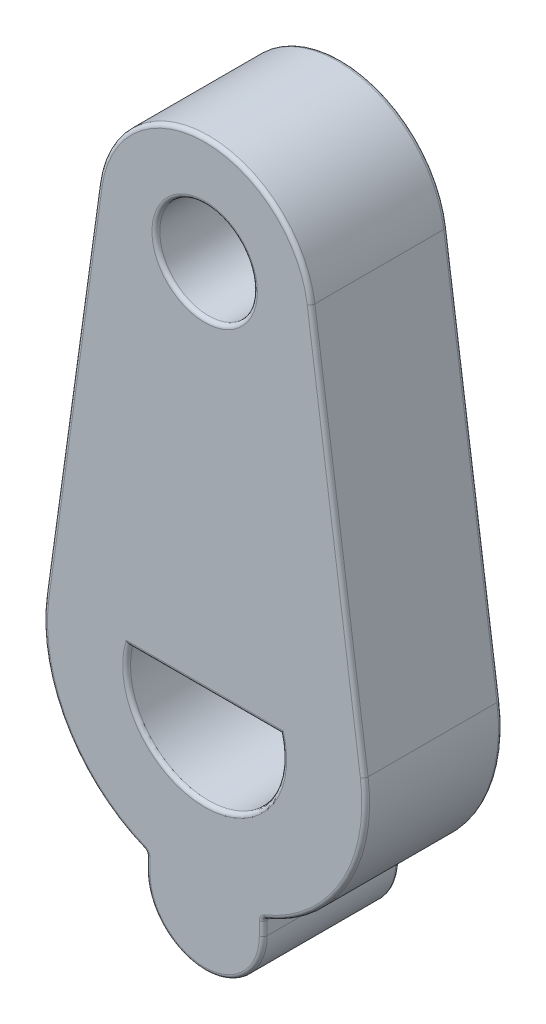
ISO-10303-21;
HEADER;
FILE_DESCRIPTION(('STEP AP214'),'2;1');
FILE_NAME('part.step','',(''),(''),'','','');
FILE_SCHEMA(('AUTOMOTIVE_DESIGN { 1 0 10303 214 1 1 1 1 }'));
ENDSEC;
DATA;
#1=APPLICATION_CONTEXT('core data for automotive mechanical design processes');
#2=APPLICATION_PROTOCOL_DEFINITION('international standard','automotive_design',2000,#1);
#3=PRODUCT_CONTEXT('',#1,'mechanical');
#4=PRODUCT('Part','Part','',(#3));
#5=PRODUCT_RELATED_PRODUCT_CATEGORY('part','',(#4));
#6=PRODUCT_DEFINITION_FORMATION('','',#4);
#7=PRODUCT_DEFINITION_CONTEXT('part definition',#1,'design');
#8=PRODUCT_DEFINITION('design','',#6,#7);
#9=PRODUCT_DEFINITION_SHAPE('','',#8);
#10=(LENGTH_UNIT() NAMED_UNIT(*) SI_UNIT(.MILLI.,.METRE.));
#11=(NAMED_UNIT(*) PLANE_ANGLE_UNIT() SI_UNIT($,.RADIAN.));
#12=(NAMED_UNIT(*) SI_UNIT($,.STERADIAN.) SOLID_ANGLE_UNIT());
#13=UNCERTAINTY_MEASURE_WITH_UNIT(LENGTH_MEASURE(1.E-05),#10,'distance_accuracy_value','');
#14=(GEOMETRIC_REPRESENTATION_CONTEXT(3) GLOBAL_UNCERTAINTY_ASSIGNED_CONTEXT((#13)) GLOBAL_UNIT_ASSIGNED_CONTEXT((#10,
#11,#12)) REPRESENTATION_CONTEXT('',''));
#15=CARTESIAN_POINT('',(0.,0.,0.));
#16=DIRECTION('',(0.,0.,1.));
#17=DIRECTION('',(1.,0.,0.));
#18=AXIS2_PLACEMENT_3D('',#15,#16,#17);
#19=CARTESIAN_POINT('',(0.,20.,0.));
#20=DIRECTION('',(0.,0.,1.));
#21=DIRECTION('',(1.,0.,0.));
#22=AXIS2_PLACEMENT_3D('',#19,#20,#21);
#23=PLANE('',#22);
#24=CARTESIAN_POINT('',(0.,20.,0.));
#25=DIRECTION('',(0.,0.,1.));
#26=DIRECTION('',(1.,0.,0.));
#27=AXIS2_PLACEMENT_3D('',#24,#25,#26);
#28=CIRCLE('',#27,4.2);
#29=CARTESIAN_POINT('',(4.20000000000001,20.,0.));
#30=VERTEX_POINT('',#29);
#31=EDGE_CURVE('E37',#30,#30,#28,.T.);
#32=ORIENTED_EDGE('',*,*,#31,.T.);
#33=EDGE_LOOP('',(#32));
#34=FACE_BOUND('',#33,.T.);
#35=CARTESIAN_POINT('',(0.,0.,0.));
#36=DIRECTION('',(0.,0.,1.));
#37=DIRECTION('',(1.,0.,0.));
#38=AXIS2_PLACEMENT_3D('',#35,#36,#37);
#39=CIRCLE('',#38,8.05);
#40=CARTESIAN_POINT('',(-3.04911515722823,-7.45019441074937,0.));
#41=VERTEX_POINT('',#40);
#42=CARTESIAN_POINT('',(-7.97353922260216,1.106875,0.));
#43=VERTEX_POINT('',#42);
#44=EDGE_CURVE('E44',#41,#43,#39,.F.);
#45=ORIENTED_EDGE('',*,*,#44,.T.);
#46=DIRECTION('',(-0.1375,-0.990501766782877,0.));
#47=VECTOR('',#46,1.);
#48=CARTESIAN_POINT('',(-5.24965936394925,20.72875,0.));
#49=LINE('',#48,#47);
#50=CARTESIAN_POINT('',(-5.24965936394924,20.72875,0.));
#51=VERTEX_POINT('',#50);
#52=EDGE_CURVE('E327',#43,#51,#49,.F.);
#53=ORIENTED_EDGE('',*,*,#52,.T.);
#54=CARTESIAN_POINT('',(0.,20.,0.));
#55=DIRECTION('',(0.,0.,1.));
#56=DIRECTION('',(1.,0.,0.));
#57=AXIS2_PLACEMENT_3D('',#54,#55,#56);
#58=CIRCLE('',#57,5.3);
#59=CARTESIAN_POINT('',(5.24965936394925,20.72875,0.));
#60=VERTEX_POINT('',#59);
#61=EDGE_CURVE('E311',#51,#60,#58,.F.);
#62=ORIENTED_EDGE('',*,*,#61,.T.);
#63=DIRECTION('',(-0.1375,0.990501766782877,0.));
#64=VECTOR('',#63,1.);
#65=CARTESIAN_POINT('',(5.24965936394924,20.72875,0.));
#66=LINE('',#65,#64);
#67=CARTESIAN_POINT('',(7.97353922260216,1.106875,0.));
#68=VERTEX_POINT('',#67);
#69=EDGE_CURVE('E313',#60,#68,#66,.F.);
#70=ORIENTED_EDGE('',*,*,#69,.T.);
#71=CARTESIAN_POINT('',(0.,0.,0.));
#72=DIRECTION('',(0.,0.,1.));
#73=DIRECTION('',(1.,0.,0.));
#74=AXIS2_PLACEMENT_3D('',#71,#72,#73);
#75=CIRCLE('',#74,8.05);
#76=CARTESIAN_POINT('',(3.04852071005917,-7.45043767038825,0.));
#77=VERTEX_POINT('',#76);
#78=EDGE_CURVE('E315',#68,#77,#75,.F.);
#79=ORIENTED_EDGE('',*,*,#78,.T.);
#80=CARTESIAN_POINT('',(3.2,-7.82064575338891,0.));
#81=DIRECTION('',(0.,0.,1.));
#82=DIRECTION('',(1.,0.,0.));
#83=AXIS2_PLACEMENT_3D('',#80,#81,#82);
#84=CIRCLE('',#83,0.400000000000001);
#85=CARTESIAN_POINT('',(2.8,-7.82064575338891,0.));
#86=VERTEX_POINT('',#85);
#87=EDGE_CURVE('E317',#77,#86,#84,.T.);
#88=ORIENTED_EDGE('',*,*,#87,.T.);
#89=DIRECTION('',(0.,1.,0.));
#90=VECTOR('',#89,1.);
#91=CARTESIAN_POINT('',(2.8,20.,0.));
#92=LINE('',#91,#90);
#93=CARTESIAN_POINT('',(2.8,-8.5,0.));
#94=VERTEX_POINT('',#93);
#95=EDGE_CURVE('E319',#86,#94,#92,.F.);
#96=ORIENTED_EDGE('',*,*,#95,.T.);
#97=CARTESIAN_POINT('',(0.,-8.5,0.));
#98=DIRECTION('',(0.,0.,1.));
#99=DIRECTION('',(1.,0.,0.));
#100=AXIS2_PLACEMENT_3D('',#97,#98,#99);
#101=CIRCLE('',#100,2.8);
#102=CARTESIAN_POINT('',(-2.79999999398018,-8.49981639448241,0.));
#103=VERTEX_POINT('',#102);
#104=EDGE_CURVE('E321',#94,#103,#101,.F.);
#105=ORIENTED_EDGE('',*,*,#104,.T.);
#106=DIRECTION('',(0.000918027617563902,-0.999999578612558,0.));
#107=VECTOR('',#106,1.);
#108=CARTESIAN_POINT('',(-2.82616133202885,19.9974055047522,0.));
#109=LINE('',#108,#107);
#110=CARTESIAN_POINT('',(-2.80062415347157,-7.82002319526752,0.));
#111=VERTEX_POINT('',#110);
#112=EDGE_CURVE('E323',#103,#111,#109,.F.);
#113=ORIENTED_EDGE('',*,*,#112,.T.);
#114=CARTESIAN_POINT('',(-3.20062398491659,-7.82039040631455,0.));
#115=DIRECTION('',(0.,0.,1.));
#116=DIRECTION('',(1.,0.,0.));
#117=AXIS2_PLACEMENT_3D('',#114,#115,#116);
#118=CIRCLE('',#117,0.399999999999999);
#119=EDGE_CURVE('E49',#111,#41,#118,.T.);
#120=ORIENTED_EDGE('',*,*,#119,.T.);
#121=EDGE_LOOP('',(#45,#53,#62,#70,#79,#88,#96,#105,#113,#120));
#122=FACE_BOUND('',#121,.T.);
#123=CARTESIAN_POINT('',(0.,0.,0.));
#124=DIRECTION('',(0.,0.,1.));
#125=DIRECTION('',(1.,0.,0.));
#126=AXIS2_PLACEMENT_3D('',#123,#124,#125);
#127=CIRCLE('',#126,4.2);
#128=CARTESIAN_POINT('',(-4.02492235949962,1.2,0.));
#129=VERTEX_POINT('',#128);
#130=CARTESIAN_POINT('',(4.02492235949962,1.2,0.));
#131=VERTEX_POINT('',#130);
#132=EDGE_CURVE('E306',#129,#131,#127,.T.);
#133=ORIENTED_EDGE('',*,*,#132,.T.);
#134=DIRECTION('',(-1.,0.,0.));
#135=VECTOR('',#134,1.);
#136=CARTESIAN_POINT('',(-3.87298334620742,1.2,0.));
#137=LINE('',#136,#135);
#138=EDGE_CURVE('E308',#131,#129,#137,.T.);
#139=ORIENTED_EDGE('',*,*,#138,.T.);
#140=EDGE_LOOP('',(#133,#139));
#141=FACE_BOUND('',#140,.T.);
#142=ADVANCED_FACE('F29',(#34,#122,#141),#23,.F.);
#143=CARTESIAN_POINT('',(0.,20.,7.));
#144=DIRECTION('',(0.,0.,1.));
#145=DIRECTION('',(1.,0.,0.));
#146=AXIS2_PLACEMENT_3D('',#143,#144,#145);
#147=PLANE('',#146);
#148=DIRECTION('',(-1.,0.,0.));
#149=VECTOR('',#148,1.);
#150=CARTESIAN_POINT('',(0.,1.2,7.));
#151=LINE('',#150,#149);
#152=CARTESIAN_POINT('',(-4.02492235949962,1.2,7.));
#153=VERTEX_POINT('',#152);
#154=CARTESIAN_POINT('',(4.02492235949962,1.2,7.));
#155=VERTEX_POINT('',#154);
#156=EDGE_CURVE('E216',#153,#155,#151,.F.);
#157=ORIENTED_EDGE('',*,*,#156,.T.);
#158=CARTESIAN_POINT('',(0.,0.,7.));
#159=DIRECTION('',(0.,0.,1.));
#160=DIRECTION('',(1.,0.,0.));
#161=AXIS2_PLACEMENT_3D('',#158,#159,#160);
#162=CIRCLE('',#161,4.2);
#163=EDGE_CURVE('E253',#155,#153,#162,.F.);
#164=ORIENTED_EDGE('',*,*,#163,.T.);
#165=EDGE_LOOP('',(#157,#164));
#166=FACE_BOUND('',#165,.T.);
#167=CARTESIAN_POINT('',(0.,0.,7.));
#168=DIRECTION('',(0.,0.,1.));
#169=DIRECTION('',(1.,0.,0.));
#170=AXIS2_PLACEMENT_3D('',#167,#168,#169);
#171=CIRCLE('',#170,8.05);
#172=CARTESIAN_POINT('',(3.04852071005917,-7.45043767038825,7.));
#173=VERTEX_POINT('',#172);
#174=CARTESIAN_POINT('',(7.97353922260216,1.106875,7.));
#175=VERTEX_POINT('',#174);
#176=EDGE_CURVE('E247',#173,#175,#171,.T.);
#177=ORIENTED_EDGE('',*,*,#176,.T.);
#178=DIRECTION('',(-0.1375,0.990501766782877,0.));
#179=VECTOR('',#178,1.);
#180=CARTESIAN_POINT('',(5.24965936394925,20.72875,7.));
#181=LINE('',#180,#179);
#182=CARTESIAN_POINT('',(5.24965936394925,20.72875,7.));
#183=VERTEX_POINT('',#182);
#184=EDGE_CURVE('E249',#175,#183,#181,.T.);
#185=ORIENTED_EDGE('',*,*,#184,.T.);
#186=CARTESIAN_POINT('',(0.,20.,7.));
#187=DIRECTION('',(0.,0.,1.));
#188=DIRECTION('',(1.,0.,0.));
#189=AXIS2_PLACEMENT_3D('',#186,#187,#188);
#190=CIRCLE('',#189,5.3);
#191=CARTESIAN_POINT('',(-5.24965936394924,20.72875,7.));
#192=VERTEX_POINT('',#191);
#193=EDGE_CURVE('E226',#183,#192,#190,.T.);
#194=ORIENTED_EDGE('',*,*,#193,.T.);
#195=DIRECTION('',(-0.1375,-0.990501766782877,0.));
#196=VECTOR('',#195,1.);
#197=CARTESIAN_POINT('',(-7.97353922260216,1.10687499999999,7.));
#198=LINE('',#197,#196);
#199=CARTESIAN_POINT('',(-7.97353922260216,1.106875,7.));
#200=VERTEX_POINT('',#199);
#201=EDGE_CURVE('E233',#192,#200,#198,.T.);
#202=ORIENTED_EDGE('',*,*,#201,.T.);
#203=CARTESIAN_POINT('',(0.,0.,7.));
#204=DIRECTION('',(0.,0.,1.));
#205=DIRECTION('',(1.,0.,0.));
#206=AXIS2_PLACEMENT_3D('',#203,#204,#205);
#207=CIRCLE('',#206,8.05);
#208=CARTESIAN_POINT('',(-3.04911515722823,-7.45019441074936,7.));
#209=VERTEX_POINT('',#208);
#210=EDGE_CURVE('E235',#200,#209,#207,.T.);
#211=ORIENTED_EDGE('',*,*,#210,.T.);
#212=CARTESIAN_POINT('',(-3.20062398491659,-7.82039040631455,7.));
#213=DIRECTION('',(0.,0.,1.));
#214=DIRECTION('',(1.,0.,0.));
#215=AXIS2_PLACEMENT_3D('',#212,#213,#214);
#216=CIRCLE('',#215,0.399999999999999);
#217=CARTESIAN_POINT('',(-2.80062415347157,-7.82002319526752,7.));
#218=VERTEX_POINT('',#217);
#219=EDGE_CURVE('E237',#209,#218,#216,.F.);
#220=ORIENTED_EDGE('',*,*,#219,.T.);
#221=DIRECTION('',(0.000918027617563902,-0.999999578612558,0.));
#222=VECTOR('',#221,1.);
#223=CARTESIAN_POINT('',(-2.80000008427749,-8.49981639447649,7.));
#224=LINE('',#223,#222);
#225=CARTESIAN_POINT('',(-2.79999991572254,-8.49999999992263,7.));
#226=VERTEX_POINT('',#225);
#227=EDGE_CURVE('E239',#218,#226,#224,.T.);
#228=ORIENTED_EDGE('',*,*,#227,.T.);
#229=CARTESIAN_POINT('',(0.,-8.5,7.));
#230=DIRECTION('',(0.,0.,1.));
#231=DIRECTION('',(1.,0.,0.));
#232=AXIS2_PLACEMENT_3D('',#229,#230,#231);
#233=CIRCLE('',#232,2.8);
#234=CARTESIAN_POINT('',(2.8,-8.5,7.));
#235=VERTEX_POINT('',#234);
#236=EDGE_CURVE('E241',#226,#235,#233,.T.);
#237=ORIENTED_EDGE('',*,*,#236,.T.);
#238=DIRECTION('',(0.,1.,0.));
#239=VECTOR('',#238,1.);
#240=CARTESIAN_POINT('',(2.8,-7.82064575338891,7.));
#241=LINE('',#240,#239);
#242=CARTESIAN_POINT('',(2.8,-7.82064575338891,7.));
#243=VERTEX_POINT('',#242);
#244=EDGE_CURVE('E243',#235,#243,#241,.T.);
#245=ORIENTED_EDGE('',*,*,#244,.T.);
#246=CARTESIAN_POINT('',(3.2,-7.82064575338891,7.));
#247=DIRECTION('',(0.,0.,1.));
#248=DIRECTION('',(1.,0.,0.));
#249=AXIS2_PLACEMENT_3D('',#246,#247,#248);
#250=CIRCLE('',#249,0.400000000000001);
#251=EDGE_CURVE('E245',#243,#173,#250,.F.);
#252=ORIENTED_EDGE('',*,*,#251,.T.);
#253=EDGE_LOOP('',(#177,#185,#194,#202,#211,#220,#228,#237,#245,#252));
#254=FACE_BOUND('',#253,.T.);
#255=CARTESIAN_POINT('',(0.,20.,7.));
#256=DIRECTION('',(0.,0.,1.));
#257=DIRECTION('',(1.,0.,0.));
#258=AXIS2_PLACEMENT_3D('',#255,#256,#257);
#259=CIRCLE('',#258,2.7);
#260=CARTESIAN_POINT('',(2.70000000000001,20.,7.));
#261=VERTEX_POINT('',#260);
#262=EDGE_CURVE('E223',#261,#261,#259,.F.);
#263=ORIENTED_EDGE('',*,*,#262,.T.);
#264=EDGE_LOOP('',(#263));
#265=FACE_BOUND('',#264,.T.);
#266=ADVANCED_FACE('F363',(#166,#254,#265),#147,.T.);
#267=CARTESIAN_POINT('',(0.,20.,7.));
#268=DIRECTION('',(0.,0.,-1.));
#269=DIRECTION('',(-1.,0.,0.));
#270=AXIS2_PLACEMENT_3D('',#267,#268,#269);
#271=CYLINDRICAL_SURFACE('',#270,5.5);
#272=DIRECTION('',(0.,0.,-1.));
#273=VECTOR('',#272,1.);
#274=CARTESIAN_POINT('',(-5.44775971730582,20.75625,7.));
#275=LINE('',#274,#273);
#276=CARTESIAN_POINT('',(-5.44775971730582,20.75625,6.8));
#277=VERTEX_POINT('',#276);
#278=CARTESIAN_POINT('',(-5.44775971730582,20.75625,0.2));
#279=VERTEX_POINT('',#278);
#280=EDGE_CURVE('E228',#277,#279,#275,.T.);
#281=ORIENTED_EDGE('',*,*,#280,.F.);
#282=CARTESIAN_POINT('',(0.,20.,6.8));
#283=DIRECTION('',(0.,0.,1.));
#284=DIRECTION('',(1.,0.,0.));
#285=AXIS2_PLACEMENT_3D('',#282,#283,#284);
#286=CIRCLE('',#285,5.5);
#287=CARTESIAN_POINT('',(5.44775971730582,20.75625,6.8));
#288=VERTEX_POINT('',#287);
#289=EDGE_CURVE('E295',#277,#288,#286,.F.);
#290=ORIENTED_EDGE('',*,*,#289,.T.);
#291=DIRECTION('',(0.,0.,-1.));
#292=VECTOR('',#291,1.);
#293=CARTESIAN_POINT('',(5.44775971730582,20.75625,7.));
#294=LINE('',#293,#292);
#295=CARTESIAN_POINT('',(5.44775971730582,20.75625,0.2));
#296=VERTEX_POINT('',#295);
#297=EDGE_CURVE('E448',#288,#296,#294,.T.);
#298=ORIENTED_EDGE('',*,*,#297,.T.);
#299=CARTESIAN_POINT('',(0.,20.,0.2));
#300=DIRECTION('',(0.,0.,1.));
#301=DIRECTION('',(1.,0.,0.));
#302=AXIS2_PLACEMENT_3D('',#299,#300,#301);
#303=CIRCLE('',#302,5.5);
#304=EDGE_CURVE('E293',#296,#279,#303,.T.);
#305=ORIENTED_EDGE('',*,*,#304,.T.);
#306=EDGE_LOOP('',(#281,#290,#298,#305));
#307=FACE_BOUND('',#306,.T.);
#308=ADVANCED_FACE('F31',(#307),#271,.T.);
#309=CARTESIAN_POINT('',(-5.44775971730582,20.75625,7.));
#310=DIRECTION('',(0.990501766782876,-0.1375,0.));
#311=DIRECTION('',(0.1375,0.990501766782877,0.));
#312=AXIS2_PLACEMENT_3D('',#309,#310,#311);
#313=PLANE('',#312);
#314=DIRECTION('',(0.,0.,-1.));
#315=VECTOR('',#314,1.);
#316=CARTESIAN_POINT('',(-8.17163957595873,1.134375,7.));
#317=LINE('',#316,#315);
#318=CARTESIAN_POINT('',(-8.17163957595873,1.134375,6.8));
#319=VERTEX_POINT('',#318);
#320=CARTESIAN_POINT('',(-8.17163957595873,1.134375,0.2));
#321=VERTEX_POINT('',#320);
#322=EDGE_CURVE('E414',#319,#321,#317,.T.);
#323=ORIENTED_EDGE('',*,*,#322,.F.);
#324=DIRECTION('',(-0.1375,-0.990501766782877,0.));
#325=VECTOR('',#324,1.);
#326=CARTESIAN_POINT('',(-5.44775971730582,20.75625,6.8));
#327=LINE('',#326,#325);
#328=EDGE_CURVE('E291',#319,#277,#327,.F.);
#329=ORIENTED_EDGE('',*,*,#328,.T.);
#330=ORIENTED_EDGE('',*,*,#280,.T.);
#331=DIRECTION('',(-0.1375,-0.990501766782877,0.));
#332=VECTOR('',#331,1.);
#333=CARTESIAN_POINT('',(-5.44775971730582,20.75625,0.2));
#334=LINE('',#333,#332);
#335=EDGE_CURVE('E288',#279,#321,#334,.T.);
#336=ORIENTED_EDGE('',*,*,#335,.T.);
#337=EDGE_LOOP('',(#323,#329,#330,#336));
#338=FACE_BOUND('',#337,.T.);
#339=ADVANCED_FACE('F404',(#338),#313,.F.);
#340=CARTESIAN_POINT('',(0.,0.,7.));
#341=DIRECTION('',(0.,0.,-1.));
#342=DIRECTION('',(-1.,0.,0.));
#343=AXIS2_PLACEMENT_3D('',#340,#341,#342);
#344=CYLINDRICAL_SURFACE('',#343,8.25);
#345=DIRECTION('',(0.,0.,-1.));
#346=VECTOR('',#345,1.);
#347=CARTESIAN_POINT('',(-3.12486957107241,-7.63529240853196,7.));
#348=LINE('',#347,#346);
#349=CARTESIAN_POINT('',(-3.12486957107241,-7.63529240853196,6.8));
#350=VERTEX_POINT('',#349);
#351=CARTESIAN_POINT('',(-3.12486957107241,-7.63529240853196,0.2));
#352=VERTEX_POINT('',#351);
#353=EDGE_CURVE('E420',#350,#352,#348,.T.);
#354=ORIENTED_EDGE('',*,*,#353,.F.);
#355=CARTESIAN_POINT('',(0.,0.,6.8));
#356=DIRECTION('',(0.,0.,1.));
#357=DIRECTION('',(1.,0.,0.));
#358=AXIS2_PLACEMENT_3D('',#355,#356,#357);
#359=CIRCLE('',#358,8.25);
#360=EDGE_CURVE('E286',#350,#319,#359,.F.);
#361=ORIENTED_EDGE('',*,*,#360,.T.);
#362=ORIENTED_EDGE('',*,*,#322,.T.);
#363=CARTESIAN_POINT('',(0.,0.,0.2));
#364=DIRECTION('',(0.,0.,1.));
#365=DIRECTION('',(1.,0.,0.));
#366=AXIS2_PLACEMENT_3D('',#363,#364,#365);
#367=CIRCLE('',#366,8.25);
#368=EDGE_CURVE('E284',#321,#352,#367,.T.);
#369=ORIENTED_EDGE('',*,*,#368,.T.);
#370=EDGE_LOOP('',(#354,#361,#362,#369));
#371=FACE_BOUND('',#370,.T.);
#372=ADVANCED_FACE('F401',(#371),#344,.T.);
#373=CARTESIAN_POINT('',(-3.20062398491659,-7.82039040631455,7.));
#374=DIRECTION('',(0.,0.,-1.));
#375=DIRECTION('',(-1.,0.,0.));
#376=AXIS2_PLACEMENT_3D('',#373,#374,#375);
#377=CYLINDRICAL_SURFACE('',#376,0.199999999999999);
#378=DIRECTION('',(0.,0.,-1.));
#379=VECTOR('',#378,1.);
#380=CARTESIAN_POINT('',(-3.00062406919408,-7.82020680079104,7.));
#381=LINE('',#380,#379);
#382=CARTESIAN_POINT('',(-3.00062406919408,-7.82020680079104,6.8));
#383=VERTEX_POINT('',#382);
#384=CARTESIAN_POINT('',(-3.00062406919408,-7.82020680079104,0.2));
#385=VERTEX_POINT('',#384);
#386=EDGE_CURVE('E531',#383,#385,#381,.T.);
#387=ORIENTED_EDGE('',*,*,#386,.F.);
#388=CARTESIAN_POINT('',(-3.20062398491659,-7.82039040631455,6.8));
#389=DIRECTION('',(0.,0.,1.));
#390=DIRECTION('',(1.,0.,0.));
#391=AXIS2_PLACEMENT_3D('',#388,#389,#390);
#392=CIRCLE('',#391,0.199999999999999);
#393=EDGE_CURVE('E282',#383,#350,#392,.T.);
#394=ORIENTED_EDGE('',*,*,#393,.T.);
#395=ORIENTED_EDGE('',*,*,#353,.T.);
#396=CARTESIAN_POINT('',(-3.20062398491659,-7.82039040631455,0.2));
#397=DIRECTION('',(0.,0.,1.));
#398=DIRECTION('',(1.,0.,0.));
#399=AXIS2_PLACEMENT_3D('',#396,#397,#398);
#400=CIRCLE('',#399,0.199999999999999);
#401=EDGE_CURVE('E280',#352,#385,#400,.F.);
#402=ORIENTED_EDGE('',*,*,#401,.T.);
#403=EDGE_LOOP('',(#387,#394,#395,#402));
#404=FACE_BOUND('',#403,.T.);
#405=ADVANCED_FACE('F397',(#404),#377,.F.);
#406=CARTESIAN_POINT('',(-3.,-8.5,7.));
#407=DIRECTION('',(0.999999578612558,0.000918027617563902,0.));
#408=DIRECTION('',(-0.000918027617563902,0.999999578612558,0.));
#409=AXIS2_PLACEMENT_3D('',#406,#407,#408);
#410=PLANE('',#409);
#411=DIRECTION('',(0.,0.,-1.));
#412=VECTOR('',#411,1.);
#413=CARTESIAN_POINT('',(-3.,-8.5,7.));
#414=LINE('',#413,#412);
#415=CARTESIAN_POINT('',(-3.,-8.5,6.8));
#416=VERTEX_POINT('',#415);
#417=CARTESIAN_POINT('',(-3.,-8.5,0.2));
#418=VERTEX_POINT('',#417);
#419=EDGE_CURVE('E528',#416,#418,#414,.T.);
#420=ORIENTED_EDGE('',*,*,#419,.F.);
#421=DIRECTION('',(0.000918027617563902,-0.999999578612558,0.));
#422=VECTOR('',#421,1.);
#423=CARTESIAN_POINT('',(-3.00062406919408,-7.82020680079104,6.8));
#424=LINE('',#423,#422);
#425=EDGE_CURVE('E278',#416,#383,#424,.F.);
#426=ORIENTED_EDGE('',*,*,#425,.T.);
#427=ORIENTED_EDGE('',*,*,#386,.T.);
#428=DIRECTION('',(0.000918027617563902,-0.999999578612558,0.));
#429=VECTOR('',#428,1.);
#430=CARTESIAN_POINT('',(-3.,-8.5,0.2));
#431=LINE('',#430,#429);
#432=EDGE_CURVE('E276',#385,#418,#431,.T.);
#433=ORIENTED_EDGE('',*,*,#432,.T.);
#434=EDGE_LOOP('',(#420,#426,#427,#433));
#435=FACE_BOUND('',#434,.T.);
#436=ADVANCED_FACE('F393',(#435),#410,.F.);
#437=CARTESIAN_POINT('',(0.,-8.5,7.));
#438=DIRECTION('',(0.,0.,-1.));
#439=DIRECTION('',(-1.,0.,0.));
#440=AXIS2_PLACEMENT_3D('',#437,#438,#439);
#441=CYLINDRICAL_SURFACE('',#440,3.);
#442=DIRECTION('',(0.,0.,-1.));
#443=VECTOR('',#442,1.);
#444=CARTESIAN_POINT('',(3.,-8.5,7.));
#445=LINE('',#444,#443);
#446=CARTESIAN_POINT('',(3.,-8.5,6.8));
#447=VERTEX_POINT('',#446);
#448=CARTESIAN_POINT('',(3.,-8.5,0.2));
#449=VERTEX_POINT('',#448);
#450=EDGE_CURVE('E525',#447,#449,#445,.T.);
#451=ORIENTED_EDGE('',*,*,#450,.F.);
#452=CARTESIAN_POINT('',(0.,-8.5,6.8));
#453=DIRECTION('',(0.,0.,1.));
#454=DIRECTION('',(1.,0.,0.));
#455=AXIS2_PLACEMENT_3D('',#452,#453,#454);
#456=CIRCLE('',#455,3.);
#457=EDGE_CURVE('E274',#447,#416,#456,.F.);
#458=ORIENTED_EDGE('',*,*,#457,.T.);
#459=ORIENTED_EDGE('',*,*,#419,.T.);
#460=CARTESIAN_POINT('',(0.,-8.5,0.2));
#461=DIRECTION('',(0.,0.,1.));
#462=DIRECTION('',(1.,0.,0.));
#463=AXIS2_PLACEMENT_3D('',#460,#461,#462);
#464=CIRCLE('',#463,3.);
#465=EDGE_CURVE('E272',#418,#449,#464,.T.);
#466=ORIENTED_EDGE('',*,*,#465,.T.);
#467=EDGE_LOOP('',(#451,#458,#459,#466));
#468=FACE_BOUND('',#467,.T.);
#469=ADVANCED_FACE('F389',(#468),#441,.T.);
#470=CARTESIAN_POINT('',(3.,-8.5,7.));
#471=DIRECTION('',(-1.,0.,0.));
#472=DIRECTION('',(0.,0.,1.));
#473=AXIS2_PLACEMENT_3D('',#470,#471,#472);
#474=PLANE('',#473);
#475=DIRECTION('',(0.,0.,-1.));
#476=VECTOR('',#475,1.);
#477=CARTESIAN_POINT('',(3.,-7.82064575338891,7.));
#478=LINE('',#477,#476);
#479=CARTESIAN_POINT('',(3.,-7.82064575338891,6.8));
#480=VERTEX_POINT('',#479);
#481=CARTESIAN_POINT('',(3.,-7.82064575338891,0.2));
#482=VERTEX_POINT('',#481);
#483=EDGE_CURVE('E476',#480,#482,#478,.T.);
#484=ORIENTED_EDGE('',*,*,#483,.F.);
#485=DIRECTION('',(0.,1.,0.));
#486=VECTOR('',#485,1.);
#487=CARTESIAN_POINT('',(3.,-8.5,6.8));
#488=LINE('',#487,#486);
#489=EDGE_CURVE('E270',#480,#447,#488,.F.);
#490=ORIENTED_EDGE('',*,*,#489,.T.);
#491=ORIENTED_EDGE('',*,*,#450,.T.);
#492=DIRECTION('',(0.,1.,0.));
#493=VECTOR('',#492,1.);
#494=CARTESIAN_POINT('',(3.,-8.5,0.2));
#495=LINE('',#494,#493);
#496=EDGE_CURVE('E268',#449,#482,#495,.T.);
#497=ORIENTED_EDGE('',*,*,#496,.T.);
#498=EDGE_LOOP('',(#484,#490,#491,#497));
#499=FACE_BOUND('',#498,.T.);
#500=ADVANCED_FACE('F385',(#499),#474,.F.);
#501=CARTESIAN_POINT('',(3.2,-7.82064575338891,7.));
#502=DIRECTION('',(0.,0.,-1.));
#503=DIRECTION('',(-1.,0.,0.));
#504=AXIS2_PLACEMENT_3D('',#501,#502,#503);
#505=CYLINDRICAL_SURFACE('',#504,0.200000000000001);
#506=DIRECTION('',(0.,0.,-1.));
#507=VECTOR('',#506,1.);
#508=CARTESIAN_POINT('',(3.12426035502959,-7.63554171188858,7.));
#509=LINE('',#508,#507);
#510=CARTESIAN_POINT('',(3.12426035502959,-7.63554171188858,6.8));
#511=VERTEX_POINT('',#510);
#512=CARTESIAN_POINT('',(3.12426035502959,-7.63554171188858,0.2));
#513=VERTEX_POINT('',#512);
#514=EDGE_CURVE('E470',#511,#513,#509,.T.);
#515=ORIENTED_EDGE('',*,*,#514,.F.);
#516=CARTESIAN_POINT('',(3.2,-7.82064575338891,6.8));
#517=DIRECTION('',(0.,0.,1.));
#518=DIRECTION('',(1.,0.,0.));
#519=AXIS2_PLACEMENT_3D('',#516,#517,#518);
#520=CIRCLE('',#519,0.200000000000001);
#521=EDGE_CURVE('E266',#511,#480,#520,.T.);
#522=ORIENTED_EDGE('',*,*,#521,.T.);
#523=ORIENTED_EDGE('',*,*,#483,.T.);
#524=CARTESIAN_POINT('',(3.2,-7.82064575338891,0.2));
#525=DIRECTION('',(0.,0.,1.));
#526=DIRECTION('',(1.,0.,0.));
#527=AXIS2_PLACEMENT_3D('',#524,#525,#526);
#528=CIRCLE('',#527,0.200000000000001);
#529=EDGE_CURVE('E264',#482,#513,#528,.F.);
#530=ORIENTED_EDGE('',*,*,#529,.T.);
#531=EDGE_LOOP('',(#515,#522,#523,#530));
#532=FACE_BOUND('',#531,.T.);
#533=ADVANCED_FACE('F381',(#532),#505,.F.);
#534=CARTESIAN_POINT('',(0.,0.,7.));
#535=DIRECTION('',(0.,0.,-1.));
#536=DIRECTION('',(-1.,0.,0.));
#537=AXIS2_PLACEMENT_3D('',#534,#535,#536);
#538=CYLINDRICAL_SURFACE('',#537,8.25);
#539=DIRECTION('',(0.,0.,-1.));
#540=VECTOR('',#539,1.);
#541=CARTESIAN_POINT('',(8.17163957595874,1.134375,7.));
#542=LINE('',#541,#540);
#543=CARTESIAN_POINT('',(8.17163957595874,1.134375,6.8));
#544=VERTEX_POINT('',#543);
#545=CARTESIAN_POINT('',(8.17163957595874,1.134375,0.2));
#546=VERTEX_POINT('',#545);
#547=EDGE_CURVE('E454',#544,#546,#542,.T.);
#548=ORIENTED_EDGE('',*,*,#547,.F.);
#549=CARTESIAN_POINT('',(0.,0.,6.8));
#550=DIRECTION('',(0.,0.,1.));
#551=DIRECTION('',(1.,0.,0.));
#552=AXIS2_PLACEMENT_3D('',#549,#550,#551);
#553=CIRCLE('',#552,8.25);
#554=EDGE_CURVE('E262',#544,#511,#553,.F.);
#555=ORIENTED_EDGE('',*,*,#554,.T.);
#556=ORIENTED_EDGE('',*,*,#514,.T.);
#557=CARTESIAN_POINT('',(0.,0.,0.2));
#558=DIRECTION('',(0.,0.,1.));
#559=DIRECTION('',(1.,0.,0.));
#560=AXIS2_PLACEMENT_3D('',#557,#558,#559);
#561=CIRCLE('',#560,8.25);
#562=EDGE_CURVE('E260',#513,#546,#561,.T.);
#563=ORIENTED_EDGE('',*,*,#562,.T.);
#564=EDGE_LOOP('',(#548,#555,#556,#563));
#565=FACE_BOUND('',#564,.T.);
#566=ADVANCED_FACE('F377',(#565),#538,.T.);
#567=CARTESIAN_POINT('',(5.44775971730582,20.75625,7.));
#568=DIRECTION('',(-0.990501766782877,-0.1375,0.));
#569=DIRECTION('',(0.1375,-0.990501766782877,0.));
#570=AXIS2_PLACEMENT_3D('',#567,#568,#569);
#571=PLANE('',#570);
#572=ORIENTED_EDGE('',*,*,#297,.F.);
#573=DIRECTION('',(-0.1375,0.990501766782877,0.));
#574=VECTOR('',#573,1.);
#575=CARTESIAN_POINT('',(8.17163957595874,1.134375,6.8));
#576=LINE('',#575,#574);
#577=EDGE_CURVE('E257',#288,#544,#576,.F.);
#578=ORIENTED_EDGE('',*,*,#577,.T.);
#579=ORIENTED_EDGE('',*,*,#547,.T.);
#580=DIRECTION('',(-0.1375,0.990501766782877,0.));
#581=VECTOR('',#580,1.);
#582=CARTESIAN_POINT('',(5.44775971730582,20.75625,0.2));
#583=LINE('',#582,#581);
#584=EDGE_CURVE('E203',#546,#296,#583,.T.);
#585=ORIENTED_EDGE('',*,*,#584,.T.);
#586=EDGE_LOOP('',(#572,#578,#579,#585));
#587=FACE_BOUND('',#586,.T.);
#588=ADVANCED_FACE('F374',(#587),#571,.F.);
#589=CARTESIAN_POINT('',(0.,20.,7.));
#590=DIRECTION('',(0.,0.,-1.));
#591=DIRECTION('',(-1.,0.,0.));
#592=AXIS2_PLACEMENT_3D('',#589,#590,#591);
#593=CYLINDRICAL_SURFACE('',#592,2.5);
#594=CARTESIAN_POINT('',(0.,20.,6.8));
#595=DIRECTION('',(0.,0.,1.));
#596=DIRECTION('',(1.,0.,0.));
#597=AXIS2_PLACEMENT_3D('',#594,#595,#596);
#598=CIRCLE('',#597,2.5);
#599=CARTESIAN_POINT('',(2.50000000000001,20.,6.8));
#600=VERTEX_POINT('',#599);
#601=EDGE_CURVE('E297',#600,#600,#598,.T.);
#602=ORIENTED_EDGE('',*,*,#601,.T.);
#603=EDGE_LOOP('',(#602));
#604=FACE_BOUND('',#603,.T.);
#605=CARTESIAN_POINT('',(0.,20.,0.));
#606=DIRECTION('',(0.,0.,1.));
#607=DIRECTION('',(1.,0.,0.));
#608=AXIS2_PLACEMENT_3D('',#605,#606,#607);
#609=CIRCLE('',#608,2.5);
#610=CARTESIAN_POINT('',(2.50000000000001,20.,0.));
#611=VERTEX_POINT('',#610);
#612=EDGE_CURVE('E455',#611,#611,#609,.T.);
#613=ORIENTED_EDGE('',*,*,#612,.F.);
#614=EDGE_LOOP('',(#613));
#615=FACE_BOUND('',#614,.T.);
#616=ADVANCED_FACE('F371',(#604,#615),#593,.F.);
#617=CARTESIAN_POINT('',(0.,0.,7.));
#618=DIRECTION('',(0.,0.,-1.));
#619=DIRECTION('',(-1.,0.,0.));
#620=AXIS2_PLACEMENT_3D('',#617,#618,#619);
#621=CYLINDRICAL_SURFACE('',#620,4.);
#622=DIRECTION('',(0.,0.,-1.));
#623=VECTOR('',#622,1.);
#624=CARTESIAN_POINT('',(-3.87298334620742,1.,7.));
#625=LINE('',#624,#623);
#626=CARTESIAN_POINT('',(-3.87298334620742,1.,6.8));
#627=VERTEX_POINT('',#626);
#628=CARTESIAN_POINT('',(-3.87298334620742,1.,0.200000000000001));
#629=VERTEX_POINT('',#628);
#630=EDGE_CURVE('E195',#627,#629,#625,.T.);
#631=ORIENTED_EDGE('',*,*,#630,.F.);
#632=CARTESIAN_POINT('',(0.,0.,6.8));
#633=DIRECTION('',(0.,0.,1.));
#634=DIRECTION('',(1.,0.,0.));
#635=AXIS2_PLACEMENT_3D('',#632,#633,#634);
#636=CIRCLE('',#635,4.);
#637=CARTESIAN_POINT('',(3.87298334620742,1.,6.8));
#638=VERTEX_POINT('',#637);
#639=EDGE_CURVE('E209',#627,#638,#636,.T.);
#640=ORIENTED_EDGE('',*,*,#639,.T.);
#641=DIRECTION('',(0.,0.,-1.));
#642=VECTOR('',#641,1.);
#643=CARTESIAN_POINT('',(3.87298334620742,1.,7.));
#644=LINE('',#643,#642);
#645=CARTESIAN_POINT('',(3.87298334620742,1.,0.2));
#646=VERTEX_POINT('',#645);
#647=EDGE_CURVE('E198',#638,#646,#644,.T.);
#648=ORIENTED_EDGE('',*,*,#647,.T.);
#649=CARTESIAN_POINT('',(0.,0.,0.2));
#650=DIRECTION('',(0.,0.,1.));
#651=DIRECTION('',(1.,0.,0.));
#652=AXIS2_PLACEMENT_3D('',#649,#650,#651);
#653=CIRCLE('',#652,4.);
#654=EDGE_CURVE('E211',#646,#629,#653,.F.);
#655=ORIENTED_EDGE('',*,*,#654,.T.);
#656=EDGE_LOOP('',(#631,#640,#648,#655));
#657=FACE_BOUND('',#656,.T.);
#658=ADVANCED_FACE('F207',(#657),#621,.F.);
#659=CARTESIAN_POINT('',(-3.87298334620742,1.,7.));
#660=DIRECTION('',(0.,-1.,0.));
#661=DIRECTION('',(0.,0.,-1.));
#662=AXIS2_PLACEMENT_3D('',#659,#660,#661);
#663=PLANE('',#662);
#664=ORIENTED_EDGE('',*,*,#647,.F.);
#665=DIRECTION('',(-1.,0.,0.));
#666=VECTOR('',#665,1.);
#667=CARTESIAN_POINT('',(-3.87298334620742,1.,6.8));
#668=LINE('',#667,#666);
#669=EDGE_CURVE('E191',#638,#627,#668,.T.);
#670=ORIENTED_EDGE('',*,*,#669,.T.);
#671=ORIENTED_EDGE('',*,*,#630,.T.);
#672=DIRECTION('',(-1.,0.,0.));
#673=VECTOR('',#672,1.);
#674=CARTESIAN_POINT('',(3.87298334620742,1.,0.2));
#675=LINE('',#674,#673);
#676=EDGE_CURVE('E204',#629,#646,#675,.F.);
#677=ORIENTED_EDGE('',*,*,#676,.T.);
#678=EDGE_LOOP('',(#664,#670,#671,#677));
#679=FACE_BOUND('',#678,.T.);
#680=ADVANCED_FACE('F193',(#679),#663,.T.);
#681=CARTESIAN_POINT('',(0.,20.,0.));
#682=DIRECTION('',(0.,0.,-1.));
#683=DIRECTION('',(-1.,0.,0.));
#684=AXIS2_PLACEMENT_3D('',#681,#682,#683);
#685=PLANE('',#684);
#686=ORIENTED_EDGE('',*,*,#612,.T.);
#687=EDGE_LOOP('',(#686));
#688=FACE_BOUND('',#687,.T.);
#689=ADVANCED_FACE('F344',(#688),#685,.F.);
#690=CARTESIAN_POINT('',(0.,20.,-1.));
#691=DIRECTION('',(0.,0.,1.));
#692=DIRECTION('',(1.,0.,0.));
#693=AXIS2_PLACEMENT_3D('',#690,#691,#692);
#694=CYLINDRICAL_SURFACE('',#693,4.);
#695=CARTESIAN_POINT('',(0.,20.,-0.2));
#696=DIRECTION('',(0.,0.,1.));
#697=DIRECTION('',(1.,0.,0.));
#698=AXIS2_PLACEMENT_3D('',#695,#696,#697);
#699=CIRCLE('',#698,4.);
#700=CARTESIAN_POINT('',(4.00000000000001,20.,-0.2));
#701=VERTEX_POINT('',#700);
#702=EDGE_CURVE('E303',#701,#701,#699,.F.);
#703=ORIENTED_EDGE('',*,*,#702,.T.);
#704=EDGE_LOOP('',(#703));
#705=FACE_BOUND('',#704,.T.);
#706=CARTESIAN_POINT('',(0.,20.,-0.8));
#707=DIRECTION('',(0.,0.,-1.));
#708=DIRECTION('',(-1.,0.,0.));
#709=AXIS2_PLACEMENT_3D('',#706,#707,#708);
#710=CIRCLE('',#709,4.);
#711=CARTESIAN_POINT('',(-3.99999999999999,20.,-0.8));
#712=VERTEX_POINT('',#711);
#713=EDGE_CURVE('E300',#712,#712,#710,.F.);
#714=ORIENTED_EDGE('',*,*,#713,.T.);
#715=EDGE_LOOP('',(#714));
#716=FACE_BOUND('',#715,.T.);
#717=ADVANCED_FACE('F340',(#705,#716),#694,.T.);
#718=CARTESIAN_POINT('',(0.,20.,-1.));
#719=DIRECTION('',(0.,0.,-1.));
#720=DIRECTION('',(-1.,0.,0.));
#721=AXIS2_PLACEMENT_3D('',#718,#719,#720);
#722=PLANE('',#721);
#723=CARTESIAN_POINT('',(0.,20.,-1.));
#724=DIRECTION('',(0.,0.,-1.));
#725=DIRECTION('',(-1.,0.,0.));
#726=AXIS2_PLACEMENT_3D('',#723,#724,#725);
#727=CIRCLE('',#726,3.8);
#728=CARTESIAN_POINT('',(-3.79999999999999,20.,-1.));
#729=VERTEX_POINT('',#728);
#730=EDGE_CURVE('E11',#729,#729,#727,.T.);
#731=ORIENTED_EDGE('',*,*,#730,.T.);
#732=EDGE_LOOP('',(#731));
#733=FACE_BOUND('',#732,.T.);
#734=ADVANCED_FACE('F343',(#733),#722,.T.);
#735=CARTESIAN_POINT('',(-3.87298334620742,1.2,6.8));
#736=DIRECTION('',(-1.,0.,0.));
#737=DIRECTION('',(0.,0.,1.));
#738=AXIS2_PLACEMENT_3D('',#735,#736,#737);
#739=CYLINDRICAL_SURFACE('',#738,0.2);
#740=CARTESIAN_POINT('',(3.87298334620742,1.,6.8));
#741=CARTESIAN_POINT('',(3.87297177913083,0.999985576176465,6.80960959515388));
#742=CARTESIAN_POINT('',(3.87351901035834,1.00069153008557,6.81920228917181));
#743=CARTESIAN_POINT('',(3.87563410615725,1.00342297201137,6.83802267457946));
#744=CARTESIAN_POINT('',(3.87719552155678,1.00544012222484,6.84725228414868));
#745=CARTESIAN_POINT('',(3.88124066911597,1.01067088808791,6.86512761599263));
#746=CARTESIAN_POINT('',(3.8837227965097,1.0138824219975,6.87377432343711));
#747=CARTESIAN_POINT('',(3.88947473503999,1.02133423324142,6.89033878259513));
#748=CARTESIAN_POINT('',(3.89274565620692,1.02557596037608,6.89825548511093));
#749=CARTESIAN_POINT('',(3.90020276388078,1.03526112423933,6.91380337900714));
#750=CARTESIAN_POINT('',(3.90443912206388,1.04077073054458,6.92136888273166));
#751=CARTESIAN_POINT('',(3.91349622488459,1.05257202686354,6.93546050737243));
#752=CARTESIAN_POINT('',(3.91831709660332,1.05886388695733,6.9419864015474));
#753=CARTESIAN_POINT('',(3.92942058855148,1.07338492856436,6.95518778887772));
#754=CARTESIAN_POINT('',(3.93580242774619,1.0817495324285,6.96163061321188));
#755=CARTESIAN_POINT('',(3.94902381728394,1.0991242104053,6.97300901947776));
#756=CARTESIAN_POINT('',(3.9558639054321,1.10813504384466,6.97794279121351));
#757=CARTESIAN_POINT('',(3.97128561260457,1.12850641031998,6.98718507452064));
#758=CARTESIAN_POINT('',(3.97993569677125,1.13996856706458,6.99115535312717));
#759=CARTESIAN_POINT('',(3.99744120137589,1.16324328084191,6.99695810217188));
#760=CARTESIAN_POINT('',(4.00629628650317,1.17505527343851,6.99879384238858));
#761=CARTESIAN_POINT('',(4.01783642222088,1.19050037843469,6.99980659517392));
#762=CARTESIAN_POINT('',(4.02051648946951,1.19409094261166,6.99994497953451));
#763=CARTESIAN_POINT('',(4.02377113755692,1.19845563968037,6.99999552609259));
#764=CARTESIAN_POINT('',(4.02434678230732,1.19922778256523,6.99999999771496));
#765=CARTESIAN_POINT('',(4.02492235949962,1.2,7.));
#766=B_SPLINE_CURVE_WITH_KNOTS('',3,(#740,#741,#742,#743,#744,#745,#746,#747,#748,#749,#750,
#751,#752,#753,#754,#755,#756,#757,#758,#759,#760,#761,#762,#763,#764,#765),.UNSPECIFIED.,.F.,
.F.,(4,2,2,2,2,2,2,2,2,2,2,2,4),(0.,0.0287606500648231,0.0573401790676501,0.0858701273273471,
0.114440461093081,0.14514857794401,0.175863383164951,0.212740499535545,0.24966168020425,
0.294189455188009,0.338648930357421,0.352094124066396,0.35498344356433),.UNSPECIFIED.);
#767=EDGE_CURVE('E220',#155,#638,#766,.F.);
#768=ORIENTED_EDGE('',*,*,#767,.F.);
#769=ORIENTED_EDGE('',*,*,#156,.F.);
#770=CARTESIAN_POINT('',(-3.87298334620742,1.,6.8));
#771=CARTESIAN_POINT('',(-3.87297177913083,0.999985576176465,6.80960959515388));
#772=CARTESIAN_POINT('',(-3.87351901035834,1.00069153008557,6.81920228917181));
#773=CARTESIAN_POINT('',(-3.87563410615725,1.00342297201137,6.83802267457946));
#774=CARTESIAN_POINT('',(-3.87719552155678,1.00544012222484,6.84725228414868));
#775=CARTESIAN_POINT('',(-3.88124066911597,1.01067088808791,6.86512761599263));
#776=CARTESIAN_POINT('',(-3.8837227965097,1.0138824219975,6.87377432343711));
#777=CARTESIAN_POINT('',(-3.88947473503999,1.02133423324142,6.89033878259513));
#778=CARTESIAN_POINT('',(-3.89274565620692,1.02557596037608,6.89825548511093));
#779=CARTESIAN_POINT('',(-3.90020276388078,1.03526112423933,6.91380337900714));
#780=CARTESIAN_POINT('',(-3.90443912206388,1.04077073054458,6.92136888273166));
#781=CARTESIAN_POINT('',(-3.91349622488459,1.05257202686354,6.93546050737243));
#782=CARTESIAN_POINT('',(-3.91831709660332,1.05886388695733,6.9419864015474));
#783=CARTESIAN_POINT('',(-3.92942058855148,1.07338492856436,6.95518778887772));
#784=CARTESIAN_POINT('',(-3.93580242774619,1.0817495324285,6.96163061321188));
#785=CARTESIAN_POINT('',(-3.94902381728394,1.0991242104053,6.97300901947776));
#786=CARTESIAN_POINT('',(-3.9558639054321,1.10813504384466,6.97794279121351));
#787=CARTESIAN_POINT('',(-3.97128561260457,1.12850641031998,6.98718507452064));
#788=CARTESIAN_POINT('',(-3.97993569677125,1.13996856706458,6.99115535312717));
#789=CARTESIAN_POINT('',(-3.99744120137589,1.16324328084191,6.99695810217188));
#790=CARTESIAN_POINT('',(-4.00629628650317,1.17505527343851,6.99879384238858));
#791=CARTESIAN_POINT('',(-4.01783642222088,1.19050037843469,6.99980659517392));
#792=CARTESIAN_POINT('',(-4.02051648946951,1.19409094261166,6.99994497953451));
#793=CARTESIAN_POINT('',(-4.02377113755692,1.19845563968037,6.99999552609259));
#794=CARTESIAN_POINT('',(-4.02434678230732,1.19922778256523,6.99999999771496));
#795=CARTESIAN_POINT('',(-4.02492235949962,1.2,7.));
#796=B_SPLINE_CURVE_WITH_KNOTS('',3,(#770,#771,#772,#773,#774,#775,#776,#777,#778,#779,#780,
#781,#782,#783,#784,#785,#786,#787,#788,#789,#790,#791,#792,#793,#794,#795),.UNSPECIFIED.,.F.,
.F.,(4,2,2,2,2,2,2,2,2,2,2,2,4),(0.,0.0287606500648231,0.0573401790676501,0.0858701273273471,
0.114440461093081,0.14514857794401,0.175863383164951,0.212740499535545,0.24966168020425,
0.294189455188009,0.338648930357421,0.352094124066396,0.35498344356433),.UNSPECIFIED.);
#797=EDGE_CURVE('E212',#627,#153,#796,.T.);
#798=ORIENTED_EDGE('',*,*,#797,.F.);
#799=ORIENTED_EDGE('',*,*,#669,.F.);
#800=EDGE_LOOP('',(#768,#769,#798,#799));
#801=FACE_BOUND('',#800,.T.);
#802=ADVANCED_FACE('F215',(#801),#739,.T.);
#803=CARTESIAN_POINT('',(0.,0.,6.8));
#804=DIRECTION('',(0.,0.,1.));
#805=DIRECTION('',(1.,0.,0.));
#806=AXIS2_PLACEMENT_3D('',#803,#804,#805);
#807=TOROIDAL_SURFACE('',#806,4.2,0.2);
#808=ORIENTED_EDGE('',*,*,#797,.T.);
#809=ORIENTED_EDGE('',*,*,#163,.F.);
#810=ORIENTED_EDGE('',*,*,#767,.T.);
#811=ORIENTED_EDGE('',*,*,#639,.F.);
#812=EDGE_LOOP('',(#808,#809,#810,#811));
#813=FACE_BOUND('',#812,.T.);
#814=ADVANCED_FACE('F222',(#813),#807,.T.);
#815=CARTESIAN_POINT('',(-2.82616133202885,19.9974055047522,6.8));
#816=DIRECTION('',(-0.000918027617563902,0.999999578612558,0.));
#817=DIRECTION('',(-0.999999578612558,-0.000918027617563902,0.));
#818=AXIS2_PLACEMENT_3D('',#815,#816,#817);
#819=CYLINDRICAL_SURFACE('',#818,0.2);
#820=CARTESIAN_POINT('',(-2.80062415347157,-7.82002319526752,6.8));
#821=DIRECTION('',(-0.000918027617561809,0.999999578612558,0.));
#822=DIRECTION('',(-0.999999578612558,-0.00091802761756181,0.));
#823=AXIS2_PLACEMENT_3D('',#820,#821,#822);
#824=CIRCLE('',#823,0.2);
#825=EDGE_CURVE('E494',#383,#218,#824,.T.);
#826=ORIENTED_EDGE('',*,*,#825,.F.);
#827=ORIENTED_EDGE('',*,*,#425,.F.);
#828=CARTESIAN_POINT('',(-2.79999991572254,-8.49999999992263,6.8));
#829=DIRECTION('',(3.86843172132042E-10,-1.,0.));
#830=DIRECTION('',(1.,3.86843172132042E-10,0.));
#831=AXIS2_PLACEMENT_3D('',#828,#829,#830);
#832=CIRCLE('',#831,0.2);
#833=EDGE_CURVE('E497',#226,#416,#832,.T.);
#834=ORIENTED_EDGE('',*,*,#833,.F.);
#835=ORIENTED_EDGE('',*,*,#227,.F.);
#836=EDGE_LOOP('',(#826,#827,#834,#835));
#837=FACE_BOUND('',#836,.T.);
#838=ADVANCED_FACE('F651',(#837),#819,.T.);
#839=CARTESIAN_POINT('',(0.,-8.5,6.8));
#840=DIRECTION('',(0.,0.,1.));
#841=DIRECTION('',(1.,0.,0.));
#842=AXIS2_PLACEMENT_3D('',#839,#840,#841);
#843=TOROIDAL_SURFACE('',#842,2.8,0.2);
#844=ORIENTED_EDGE('',*,*,#833,.T.);
#845=ORIENTED_EDGE('',*,*,#457,.F.);
#846=CARTESIAN_POINT('',(2.8,-8.5,6.8));
#847=DIRECTION('',(0.,1.,0.));
#848=DIRECTION('',(0.,0.,1.));
#849=AXIS2_PLACEMENT_3D('',#846,#847,#848);
#850=CIRCLE('',#849,0.2);
#851=EDGE_CURVE('E488',#235,#447,#850,.T.);
#852=ORIENTED_EDGE('',*,*,#851,.F.);
#853=ORIENTED_EDGE('',*,*,#236,.F.);
#854=EDGE_LOOP('',(#844,#845,#852,#853));
#855=FACE_BOUND('',#854,.T.);
#856=ADVANCED_FACE('F648',(#855),#843,.T.);
#857=CARTESIAN_POINT('',(-3.20062398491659,-7.82039040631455,6.8));
#858=DIRECTION('',(0.,0.,1.));
#859=DIRECTION('',(1.,0.,0.));
#860=AXIS2_PLACEMENT_3D('',#857,#858,#859);
#861=TOROIDAL_SURFACE('',#860,0.399999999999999,0.2);
#862=ORIENTED_EDGE('',*,*,#825,.T.);
#863=ORIENTED_EDGE('',*,*,#219,.F.);
#864=CARTESIAN_POINT('',(-3.04911515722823,-7.45019441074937,6.8));
#865=DIRECTION('',(-0.925489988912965,0.378772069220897,0.));
#866=DIRECTION('',(-0.378772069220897,-0.925489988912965,0.));
#867=AXIS2_PLACEMENT_3D('',#864,#865,#866);
#868=CIRCLE('',#867,0.2);
#869=EDGE_CURVE('E486',#350,#209,#868,.T.);
#870=ORIENTED_EDGE('',*,*,#869,.F.);
#871=ORIENTED_EDGE('',*,*,#393,.F.);
#872=EDGE_LOOP('',(#862,#863,#870,#871));
#873=FACE_BOUND('',#872,.T.);
#874=ADVANCED_FACE('F645',(#873),#861,.T.);
#875=CARTESIAN_POINT('',(2.8,20.,6.8));
#876=DIRECTION('',(0.,-1.,0.));
#877=DIRECTION('',(0.,0.,-1.));
#878=AXIS2_PLACEMENT_3D('',#875,#876,#877);
#879=CYLINDRICAL_SURFACE('',#878,0.2);
#880=ORIENTED_EDGE('',*,*,#851,.T.);
#881=ORIENTED_EDGE('',*,*,#489,.F.);
#882=CARTESIAN_POINT('',(2.8,-7.82064575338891,6.8));
#883=DIRECTION('',(0.,1.,0.));
#884=DIRECTION('',(0.,0.,1.));
#885=AXIS2_PLACEMENT_3D('',#882,#883,#884);
#886=CIRCLE('',#885,0.2);
#887=EDGE_CURVE('E431',#243,#480,#886,.T.);
#888=ORIENTED_EDGE('',*,*,#887,.F.);
#889=ORIENTED_EDGE('',*,*,#244,.F.);
#890=EDGE_LOOP('',(#880,#881,#888,#889));
#891=FACE_BOUND('',#890,.T.);
#892=ADVANCED_FACE('F642',(#891),#879,.T.);
#893=CARTESIAN_POINT('',(0.,0.,6.8));
#894=DIRECTION('',(0.,0.,1.));
#895=DIRECTION('',(1.,0.,0.));
#896=AXIS2_PLACEMENT_3D('',#893,#894,#895);
#897=TOROIDAL_SURFACE('',#896,8.05,0.2);
#898=ORIENTED_EDGE('',*,*,#869,.T.);
#899=ORIENTED_EDGE('',*,*,#210,.F.);
#900=CARTESIAN_POINT('',(-7.97353922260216,1.106875,6.8));
#901=DIRECTION('',(0.1375,0.990501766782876,0.));
#902=DIRECTION('',(-0.990501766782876,0.1375,0.));
#903=AXIS2_PLACEMENT_3D('',#900,#901,#902);
#904=CIRCLE('',#903,0.2);
#905=EDGE_CURVE('E426',#319,#200,#904,.T.);
#906=ORIENTED_EDGE('',*,*,#905,.F.);
#907=ORIENTED_EDGE('',*,*,#360,.F.);
#908=EDGE_LOOP('',(#898,#899,#906,#907));
#909=FACE_BOUND('',#908,.T.);
#910=ADVANCED_FACE('F428',(#909),#897,.T.);
#911=CARTESIAN_POINT('',(3.2,-7.82064575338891,6.8));
#912=DIRECTION('',(0.,0.,1.));
#913=DIRECTION('',(1.,0.,0.));
#914=AXIS2_PLACEMENT_3D('',#911,#912,#913);
#915=TOROIDAL_SURFACE('',#914,0.400000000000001,0.2);
#916=ORIENTED_EDGE('',*,*,#887,.T.);
#917=ORIENTED_EDGE('',*,*,#521,.F.);
#918=CARTESIAN_POINT('',(3.04852071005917,-7.45043767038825,6.8));
#919=DIRECTION('',(0.925520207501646,0.378698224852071,0.));
#920=DIRECTION('',(-0.378698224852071,0.925520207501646,0.));
#921=AXIS2_PLACEMENT_3D('',#918,#919,#920);
#922=CIRCLE('',#921,0.2);
#923=EDGE_CURVE('E432',#173,#511,#922,.T.);
#924=ORIENTED_EDGE('',*,*,#923,.F.);
#925=ORIENTED_EDGE('',*,*,#251,.F.);
#926=EDGE_LOOP('',(#916,#917,#924,#925));
#927=FACE_BOUND('',#926,.T.);
#928=ADVANCED_FACE('F480',(#927),#915,.T.);
#929=CARTESIAN_POINT('',(-5.24965936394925,20.72875,6.8));
#930=DIRECTION('',(0.1375,0.990501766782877,0.));
#931=DIRECTION('',(-0.990501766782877,0.1375,0.));
#932=AXIS2_PLACEMENT_3D('',#929,#930,#931);
#933=CYLINDRICAL_SURFACE('',#932,0.2);
#934=ORIENTED_EDGE('',*,*,#905,.T.);
#935=ORIENTED_EDGE('',*,*,#201,.F.);
#936=CARTESIAN_POINT('',(-5.24965936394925,20.72875,6.8));
#937=DIRECTION('',(0.137499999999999,0.990501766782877,0.));
#938=DIRECTION('',(-0.990501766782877,0.137499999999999,0.));
#939=AXIS2_PLACEMENT_3D('',#936,#937,#938);
#940=CIRCLE('',#939,0.2);
#941=EDGE_CURVE('E437',#277,#192,#940,.T.);
#942=ORIENTED_EDGE('',*,*,#941,.F.);
#943=ORIENTED_EDGE('',*,*,#328,.F.);
#944=EDGE_LOOP('',(#934,#935,#942,#943));
#945=FACE_BOUND('',#944,.T.);
#946=ADVANCED_FACE('F435',(#945),#933,.T.);
#947=CARTESIAN_POINT('',(0.,0.,6.8));
#948=DIRECTION('',(0.,0.,1.));
#949=DIRECTION('',(1.,0.,0.));
#950=AXIS2_PLACEMENT_3D('',#947,#948,#949);
#951=TOROIDAL_SURFACE('',#950,8.05,0.2);
#952=ORIENTED_EDGE('',*,*,#923,.T.);
#953=ORIENTED_EDGE('',*,*,#554,.F.);
#954=CARTESIAN_POINT('',(7.97353922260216,1.106875,6.8));
#955=DIRECTION('',(-0.1375,0.990501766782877,0.));
#956=DIRECTION('',(-0.990501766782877,-0.1375,0.));
#957=AXIS2_PLACEMENT_3D('',#954,#955,#956);
#958=CIRCLE('',#957,0.2);
#959=EDGE_CURVE('E441',#175,#544,#958,.T.);
#960=ORIENTED_EDGE('',*,*,#959,.F.);
#961=ORIENTED_EDGE('',*,*,#176,.F.);
#962=EDGE_LOOP('',(#952,#953,#960,#961));
#963=FACE_BOUND('',#962,.T.);
#964=ADVANCED_FACE('F466',(#963),#951,.T.);
#965=CARTESIAN_POINT('',(0.,20.,6.8));
#966=DIRECTION('',(0.,0.,1.));
#967=DIRECTION('',(1.,0.,0.));
#968=AXIS2_PLACEMENT_3D('',#965,#966,#967);
#969=TOROIDAL_SURFACE('',#968,5.3,0.2);
#970=ORIENTED_EDGE('',*,*,#941,.T.);
#971=ORIENTED_EDGE('',*,*,#193,.F.);
#972=CARTESIAN_POINT('',(5.24965936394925,20.72875,6.8));
#973=DIRECTION('',(0.137499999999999,-0.990501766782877,0.));
#974=DIRECTION('',(0.990501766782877,0.137499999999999,0.));
#975=AXIS2_PLACEMENT_3D('',#972,#973,#974);
#976=CIRCLE('',#975,0.2);
#977=EDGE_CURVE('E445',#288,#183,#976,.T.);
#978=ORIENTED_EDGE('',*,*,#977,.F.);
#979=ORIENTED_EDGE('',*,*,#289,.F.);
#980=EDGE_LOOP('',(#970,#971,#978,#979));
#981=FACE_BOUND('',#980,.T.);
#982=ADVANCED_FACE('F444',(#981),#969,.T.);
#983=CARTESIAN_POINT('',(5.24965936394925,20.72875,6.8));
#984=DIRECTION('',(0.1375,-0.990501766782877,0.));
#985=DIRECTION('',(0.990501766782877,0.1375,0.));
#986=AXIS2_PLACEMENT_3D('',#983,#984,#985);
#987=CYLINDRICAL_SURFACE('',#986,0.2);
#988=ORIENTED_EDGE('',*,*,#959,.T.);
#989=ORIENTED_EDGE('',*,*,#577,.F.);
#990=ORIENTED_EDGE('',*,*,#977,.T.);
#991=ORIENTED_EDGE('',*,*,#184,.F.);
#992=EDGE_LOOP('',(#988,#989,#990,#991));
#993=FACE_BOUND('',#992,.T.);
#994=ADVANCED_FACE('F458',(#993),#987,.T.);
#995=CARTESIAN_POINT('',(0.,20.,6.8));
#996=DIRECTION('',(0.,0.,1.));
#997=DIRECTION('',(1.,0.,0.));
#998=AXIS2_PLACEMENT_3D('',#995,#996,#997);
#999=TOROIDAL_SURFACE('',#998,2.7,0.2);
#1000=ORIENTED_EDGE('',*,*,#262,.F.);
#1001=EDGE_LOOP('',(#1000));
#1002=FACE_BOUND('',#1001,.T.);
#1003=ORIENTED_EDGE('',*,*,#601,.F.);
#1004=EDGE_LOOP('',(#1003));
#1005=FACE_BOUND('',#1004,.T.);
#1006=ADVANCED_FACE('F336',(#1002,#1005),#999,.T.);
#1007=CARTESIAN_POINT('',(0.,20.,-0.2));
#1008=DIRECTION('',(0.,0.,1.));
#1009=DIRECTION('',(1.,0.,0.));
#1010=AXIS2_PLACEMENT_3D('',#1007,#1008,#1009);
#1011=TOROIDAL_SURFACE('',#1010,4.2,0.2);
#1012=ORIENTED_EDGE('',*,*,#31,.F.);
#1013=EDGE_LOOP('',(#1012));
#1014=FACE_BOUND('',#1013,.T.);
#1015=ORIENTED_EDGE('',*,*,#702,.F.);
#1016=EDGE_LOOP('',(#1015));
#1017=FACE_BOUND('',#1016,.T.);
#1018=ADVANCED_FACE('F332',(#1014,#1017),#1011,.F.);
#1019=CARTESIAN_POINT('',(2.8,-8.5,0.2));
#1020=DIRECTION('',(0.,1.,0.));
#1021=DIRECTION('',(0.,0.,1.));
#1022=AXIS2_PLACEMENT_3D('',#1019,#1020,#1021);
#1023=CYLINDRICAL_SURFACE('',#1022,0.2);
#1024=CARTESIAN_POINT('',(2.8,-8.5,0.2));
#1025=DIRECTION('',(0.,-1.,0.));
#1026=DIRECTION('',(0.,0.,-1.));
#1027=AXIS2_PLACEMENT_3D('',#1024,#1025,#1026);
#1028=CIRCLE('',#1027,0.2);
#1029=EDGE_CURVE('E581',#94,#449,#1028,.T.);
#1030=ORIENTED_EDGE('',*,*,#1029,.F.);
#1031=ORIENTED_EDGE('',*,*,#95,.F.);
#1032=CARTESIAN_POINT('',(2.8,-7.82064575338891,0.2));
#1033=DIRECTION('',(0.,1.,0.));
#1034=DIRECTION('',(0.,0.,1.));
#1035=AXIS2_PLACEMENT_3D('',#1032,#1033,#1034);
#1036=CIRCLE('',#1035,0.2);
#1037=EDGE_CURVE('E584',#482,#86,#1036,.T.);
#1038=ORIENTED_EDGE('',*,*,#1037,.F.);
#1039=ORIENTED_EDGE('',*,*,#496,.F.);
#1040=EDGE_LOOP('',(#1030,#1031,#1038,#1039));
#1041=FACE_BOUND('',#1040,.T.);
#1042=ADVANCED_FACE('F335',(#1041),#1023,.T.);
#1043=CARTESIAN_POINT('',(3.2,-7.82064575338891,0.2));
#1044=DIRECTION('',(0.,0.,1.));
#1045=DIRECTION('',(1.,0.,0.));
#1046=AXIS2_PLACEMENT_3D('',#1043,#1044,#1045);
#1047=TOROIDAL_SURFACE('',#1046,0.400000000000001,0.2);
#1048=ORIENTED_EDGE('',*,*,#1037,.T.);
#1049=ORIENTED_EDGE('',*,*,#87,.F.);
#1050=CARTESIAN_POINT('',(3.04852071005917,-7.45043767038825,0.2));
#1051=DIRECTION('',(0.925520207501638,0.378698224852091,0.));
#1052=DIRECTION('',(-0.378698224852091,0.925520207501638,0.));
#1053=AXIS2_PLACEMENT_3D('',#1050,#1051,#1052);
#1054=CIRCLE('',#1053,0.2);
#1055=EDGE_CURVE('E578',#513,#77,#1054,.T.);
#1056=ORIENTED_EDGE('',*,*,#1055,.F.);
#1057=ORIENTED_EDGE('',*,*,#529,.F.);
#1058=EDGE_LOOP('',(#1048,#1049,#1056,#1057));
#1059=FACE_BOUND('',#1058,.T.);
#1060=ADVANCED_FACE('F590',(#1059),#1047,.T.);
#1061=CARTESIAN_POINT('',(0.,-8.5,0.2));
#1062=DIRECTION('',(0.,0.,1.));
#1063=DIRECTION('',(1.,0.,0.));
#1064=AXIS2_PLACEMENT_3D('',#1061,#1062,#1063);
#1065=TOROIDAL_SURFACE('',#1064,2.8,0.2);
#1066=ORIENTED_EDGE('',*,*,#1029,.T.);
#1067=ORIENTED_EDGE('',*,*,#465,.F.);
#1068=CARTESIAN_POINT('',(-2.79999999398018,-8.49981639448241,0.2));
#1069=DIRECTION('',(-0.000918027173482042,0.999999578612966,0.));
#1070=DIRECTION('',(-0.999999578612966,-0.000918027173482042,0.));
#1071=AXIS2_PLACEMENT_3D('',#1068,#1069,#1070);
#1072=CIRCLE('',#1071,0.2);
#1073=EDGE_CURVE('E571',#103,#418,#1072,.T.);
#1074=ORIENTED_EDGE('',*,*,#1073,.F.);
#1075=ORIENTED_EDGE('',*,*,#104,.F.);
#1076=EDGE_LOOP('',(#1066,#1067,#1074,#1075));
#1077=FACE_BOUND('',#1076,.T.);
#1078=ADVANCED_FACE('F619',(#1077),#1065,.T.);
#1079=CARTESIAN_POINT('',(0.,0.,0.2));
#1080=DIRECTION('',(0.,0.,1.));
#1081=DIRECTION('',(1.,0.,0.));
#1082=AXIS2_PLACEMENT_3D('',#1079,#1080,#1081);
#1083=TOROIDAL_SURFACE('',#1082,8.05,0.2);
#1084=ORIENTED_EDGE('',*,*,#1055,.T.);
#1085=ORIENTED_EDGE('',*,*,#78,.F.);
#1086=CARTESIAN_POINT('',(7.97353922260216,1.106875,0.2));
#1087=DIRECTION('',(-0.1375,0.990501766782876,0.));
#1088=DIRECTION('',(-0.990501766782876,-0.1375,0.));
#1089=AXIS2_PLACEMENT_3D('',#1086,#1087,#1088);
#1090=CIRCLE('',#1089,0.2);
#1091=EDGE_CURVE('E567',#546,#68,#1090,.T.);
#1092=ORIENTED_EDGE('',*,*,#1091,.F.);
#1093=ORIENTED_EDGE('',*,*,#562,.F.);
#1094=EDGE_LOOP('',(#1084,#1085,#1092,#1093));
#1095=FACE_BOUND('',#1094,.T.);
#1096=ADVANCED_FACE('F602',(#1095),#1083,.T.);
#1097=CARTESIAN_POINT('',(-2.80000008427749,-8.49981639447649,0.2));
#1098=DIRECTION('',(0.000918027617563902,-0.999999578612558,0.));
#1099=DIRECTION('',(0.999999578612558,0.000918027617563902,0.));
#1100=AXIS2_PLACEMENT_3D('',#1097,#1098,#1099);
#1101=CYLINDRICAL_SURFACE('',#1100,0.2);
#1102=ORIENTED_EDGE('',*,*,#1073,.T.);
#1103=ORIENTED_EDGE('',*,*,#432,.F.);
#1104=CARTESIAN_POINT('',(-2.80062415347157,-7.82002319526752,0.2));
#1105=DIRECTION('',(-0.000918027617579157,0.999999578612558,0.));
#1106=DIRECTION('',(-0.999999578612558,-0.000918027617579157,0.));
#1107=AXIS2_PLACEMENT_3D('',#1104,#1105,#1106);
#1108=CIRCLE('',#1107,0.2);
#1109=EDGE_CURVE('E563',#111,#385,#1108,.T.);
#1110=ORIENTED_EDGE('',*,*,#1109,.F.);
#1111=ORIENTED_EDGE('',*,*,#112,.F.);
#1112=EDGE_LOOP('',(#1102,#1103,#1110,#1111));
#1113=FACE_BOUND('',#1112,.T.);
#1114=ADVANCED_FACE('F607',(#1113),#1101,.T.);
#1115=CARTESIAN_POINT('',(5.24965936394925,20.72875,0.2));
#1116=DIRECTION('',(-0.1375,0.990501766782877,0.));
#1117=DIRECTION('',(-0.990501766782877,-0.1375,0.));
#1118=AXIS2_PLACEMENT_3D('',#1115,#1116,#1117);
#1119=CYLINDRICAL_SURFACE('',#1118,0.2);
#1120=ORIENTED_EDGE('',*,*,#1091,.T.);
#1121=ORIENTED_EDGE('',*,*,#69,.F.);
#1122=CARTESIAN_POINT('',(5.24965936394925,20.72875,0.2));
#1123=DIRECTION('',(-0.137499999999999,0.990501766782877,0.));
#1124=DIRECTION('',(-0.990501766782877,-0.137499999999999,0.));
#1125=AXIS2_PLACEMENT_3D('',#1122,#1123,#1124);
#1126=CIRCLE('',#1125,0.2);
#1127=EDGE_CURVE('E568',#296,#60,#1126,.T.);
#1128=ORIENTED_EDGE('',*,*,#1127,.F.);
#1129=ORIENTED_EDGE('',*,*,#584,.F.);
#1130=EDGE_LOOP('',(#1120,#1121,#1128,#1129));
#1131=FACE_BOUND('',#1130,.T.);
#1132=ADVANCED_FACE('F605',(#1131),#1119,.T.);
#1133=CARTESIAN_POINT('',(-3.20062398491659,-7.82039040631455,0.2));
#1134=DIRECTION('',(0.,0.,1.));
#1135=DIRECTION('',(1.,0.,0.));
#1136=AXIS2_PLACEMENT_3D('',#1133,#1134,#1135);
#1137=TOROIDAL_SURFACE('',#1136,0.399999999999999,0.2);
#1138=ORIENTED_EDGE('',*,*,#1109,.T.);
#1139=ORIENTED_EDGE('',*,*,#401,.F.);
#1140=CARTESIAN_POINT('',(-3.04911515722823,-7.45019441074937,0.2));
#1141=DIRECTION('',(-0.925489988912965,0.378772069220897,0.));
#1142=DIRECTION('',(-0.378772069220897,-0.925489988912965,0.));
#1143=AXIS2_PLACEMENT_3D('',#1140,#1141,#1142);
#1144=CIRCLE('',#1143,0.2);
#1145=EDGE_CURVE('E543',#41,#352,#1144,.T.);
#1146=ORIENTED_EDGE('',*,*,#1145,.F.);
#1147=ORIENTED_EDGE('',*,*,#119,.F.);
#1148=EDGE_LOOP('',(#1138,#1139,#1146,#1147));
#1149=FACE_BOUND('',#1148,.T.);
#1150=ADVANCED_FACE('F561',(#1149),#1137,.T.);
#1151=CARTESIAN_POINT('',(0.,20.,0.2));
#1152=DIRECTION('',(0.,0.,1.));
#1153=DIRECTION('',(1.,0.,0.));
#1154=AXIS2_PLACEMENT_3D('',#1151,#1152,#1153);
#1155=TOROIDAL_SURFACE('',#1154,5.3,0.2);
#1156=ORIENTED_EDGE('',*,*,#1127,.T.);
#1157=ORIENTED_EDGE('',*,*,#61,.F.);
#1158=CARTESIAN_POINT('',(-5.24965936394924,20.72875,0.2));
#1159=DIRECTION('',(-0.137499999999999,-0.990501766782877,0.));
#1160=DIRECTION('',(0.990501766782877,-0.137499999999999,0.));
#1161=AXIS2_PLACEMENT_3D('',#1158,#1159,#1160);
#1162=CIRCLE('',#1161,0.2);
#1163=EDGE_CURVE('E539',#279,#51,#1162,.T.);
#1164=ORIENTED_EDGE('',*,*,#1163,.F.);
#1165=ORIENTED_EDGE('',*,*,#304,.F.);
#1166=EDGE_LOOP('',(#1156,#1157,#1164,#1165));
#1167=FACE_BOUND('',#1166,.T.);
#1168=ADVANCED_FACE('F541',(#1167),#1155,.T.);
#1169=CARTESIAN_POINT('',(0.,0.,0.2));
#1170=DIRECTION('',(0.,0.,1.));
#1171=DIRECTION('',(1.,0.,0.));
#1172=AXIS2_PLACEMENT_3D('',#1169,#1170,#1171);
#1173=TOROIDAL_SURFACE('',#1172,8.05,0.2);
#1174=ORIENTED_EDGE('',*,*,#1145,.T.);
#1175=ORIENTED_EDGE('',*,*,#368,.F.);
#1176=CARTESIAN_POINT('',(-7.97353922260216,1.106875,0.2));
#1177=DIRECTION('',(0.1375,0.990501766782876,0.));
#1178=DIRECTION('',(-0.990501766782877,0.1375,0.));
#1179=AXIS2_PLACEMENT_3D('',#1176,#1177,#1178);
#1180=CIRCLE('',#1179,0.2);
#1181=EDGE_CURVE('E544',#43,#321,#1180,.T.);
#1182=ORIENTED_EDGE('',*,*,#1181,.F.);
#1183=ORIENTED_EDGE('',*,*,#44,.F.);
#1184=EDGE_LOOP('',(#1174,#1175,#1182,#1183));
#1185=FACE_BOUND('',#1184,.T.);
#1186=ADVANCED_FACE('F553',(#1185),#1173,.T.);
#1187=CARTESIAN_POINT('',(-5.24965936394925,20.72875,0.2));
#1188=DIRECTION('',(-0.1375,-0.990501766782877,0.));
#1189=DIRECTION('',(0.990501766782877,-0.1375,0.));
#1190=AXIS2_PLACEMENT_3D('',#1187,#1188,#1189);
#1191=CYLINDRICAL_SURFACE('',#1190,0.2);
#1192=ORIENTED_EDGE('',*,*,#1163,.T.);
#1193=ORIENTED_EDGE('',*,*,#52,.F.);
#1194=ORIENTED_EDGE('',*,*,#1181,.T.);
#1195=ORIENTED_EDGE('',*,*,#335,.F.);
#1196=EDGE_LOOP('',(#1192,#1193,#1194,#1195));
#1197=FACE_BOUND('',#1196,.T.);
#1198=ADVANCED_FACE('F546',(#1197),#1191,.T.);
#1199=CARTESIAN_POINT('',(0.,0.,0.2));
#1200=DIRECTION('',(0.,0.,1.));
#1201=DIRECTION('',(1.,0.,0.));
#1202=AXIS2_PLACEMENT_3D('',#1199,#1200,#1201);
#1203=TOROIDAL_SURFACE('',#1202,4.2,0.2);
#1204=CARTESIAN_POINT('',(-3.87298334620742,1.,0.2));
#1205=CARTESIAN_POINT('',(-3.87297177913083,0.999985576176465,0.190390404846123));
#1206=CARTESIAN_POINT('',(-3.87351901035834,1.00069153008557,0.180797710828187));
#1207=CARTESIAN_POINT('',(-3.87563410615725,1.00342297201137,0.16197732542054));
#1208=CARTESIAN_POINT('',(-3.87719552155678,1.00544012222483,0.152747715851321));
#1209=CARTESIAN_POINT('',(-3.88124066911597,1.01067088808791,0.134872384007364));
#1210=CARTESIAN_POINT('',(-3.8837227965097,1.0138824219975,0.126225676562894));
#1211=CARTESIAN_POINT('',(-3.88947473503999,1.02133423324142,0.10966121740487));
#1212=CARTESIAN_POINT('',(-3.89274565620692,1.02557596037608,0.101744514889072));
#1213=CARTESIAN_POINT('',(-3.90020276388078,1.03526112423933,0.086196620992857));
#1214=CARTESIAN_POINT('',(-3.90443912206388,1.04077073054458,0.0786311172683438));
#1215=CARTESIAN_POINT('',(-3.91349622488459,1.05257202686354,0.0645394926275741));
#1216=CARTESIAN_POINT('',(-3.91831709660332,1.05886388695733,0.0580135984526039));
#1217=CARTESIAN_POINT('',(-3.92942058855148,1.07338492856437,0.0448122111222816));
#1218=CARTESIAN_POINT('',(-3.93580242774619,1.0817495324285,0.0383693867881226));
#1219=CARTESIAN_POINT('',(-3.94902381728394,1.0991242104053,0.0269909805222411));
#1220=CARTESIAN_POINT('',(-3.95586390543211,1.10813504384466,0.0220572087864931));
#1221=CARTESIAN_POINT('',(-3.97128561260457,1.12850641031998,0.0128149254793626));
#1222=CARTESIAN_POINT('',(-3.97993569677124,1.13996856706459,0.00884464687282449));
#1223=CARTESIAN_POINT('',(-3.99744120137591,1.1632432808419,0.00304189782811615));
#1224=CARTESIAN_POINT('',(-4.00629628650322,1.17505527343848,0.00120615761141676));
#1225=CARTESIAN_POINT('',(-4.01783642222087,1.1905003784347,0.000193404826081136));
#1226=CARTESIAN_POINT('',(-4.02051648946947,1.19409094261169,5.50204654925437E-05));
#1227=CARTESIAN_POINT('',(-4.0237711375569,1.19845563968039,4.47390740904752E-06));
#1228=CARTESIAN_POINT('',(-4.02434678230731,1.19922778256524,2.2850437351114E-09));
#1229=CARTESIAN_POINT('',(-4.02492235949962,1.2,0.));
#1230=B_SPLINE_CURVE_WITH_KNOTS('',3,(#1204,#1205,#1206,#1207,#1208,#1209,#1210,#1211,#1212,
#1213,#1214,#1215,#1216,#1217,#1218,#1219,#1220,#1221,#1222,#1223,#1224,#1225,#1226,#1227,#1228,
#1229),.UNSPECIFIED.,.F.,.F.,(4,2,2,2,2,2,2,2,2,2,2,2,4),(0.,0.0287606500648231,
0.0573401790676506,0.0858701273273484,0.114440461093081,0.14514857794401,0.175863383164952,
0.212740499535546,0.249661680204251,0.29418945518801,0.338648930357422,0.352094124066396,
0.354983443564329),.UNSPECIFIED.);
#1231=EDGE_CURVE('E875',#629,#129,#1230,.T.);
#1232=ORIENTED_EDGE('',*,*,#1231,.F.);
#1233=ORIENTED_EDGE('',*,*,#654,.F.);
#1234=CARTESIAN_POINT('',(3.87298334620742,1.,0.2));
#1235=CARTESIAN_POINT('',(3.87297177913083,0.999985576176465,0.190390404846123));
#1236=CARTESIAN_POINT('',(3.87351901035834,1.00069153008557,0.180797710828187));
#1237=CARTESIAN_POINT('',(3.87563410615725,1.00342297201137,0.16197732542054));
#1238=CARTESIAN_POINT('',(3.87719552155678,1.00544012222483,0.152747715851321));
#1239=CARTESIAN_POINT('',(3.88124066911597,1.01067088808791,0.134872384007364));
#1240=CARTESIAN_POINT('',(3.8837227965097,1.0138824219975,0.126225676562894));
#1241=CARTESIAN_POINT('',(3.88947473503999,1.02133423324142,0.10966121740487));
#1242=CARTESIAN_POINT('',(3.89274565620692,1.02557596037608,0.101744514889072));
#1243=CARTESIAN_POINT('',(3.90020276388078,1.03526112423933,0.086196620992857));
#1244=CARTESIAN_POINT('',(3.90443912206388,1.04077073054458,0.0786311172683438));
#1245=CARTESIAN_POINT('',(3.91349622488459,1.05257202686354,0.0645394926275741));
#1246=CARTESIAN_POINT('',(3.91831709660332,1.05886388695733,0.0580135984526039));
#1247=CARTESIAN_POINT('',(3.92942058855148,1.07338492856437,0.0448122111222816));
#1248=CARTESIAN_POINT('',(3.93580242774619,1.0817495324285,0.0383693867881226));
#1249=CARTESIAN_POINT('',(3.94902381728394,1.0991242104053,0.0269909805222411));
#1250=CARTESIAN_POINT('',(3.95586390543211,1.10813504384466,0.0220572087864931));
#1251=CARTESIAN_POINT('',(3.97128561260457,1.12850641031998,0.0128149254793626));
#1252=CARTESIAN_POINT('',(3.97993569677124,1.13996856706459,0.00884464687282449));
#1253=CARTESIAN_POINT('',(3.99744120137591,1.1632432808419,0.00304189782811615));
#1254=CARTESIAN_POINT('',(4.00629628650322,1.17505527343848,0.00120615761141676));
#1255=CARTESIAN_POINT('',(4.01783642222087,1.1905003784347,0.000193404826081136));
#1256=CARTESIAN_POINT('',(4.02051648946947,1.19409094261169,5.50204654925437E-05));
#1257=CARTESIAN_POINT('',(4.0237711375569,1.19845563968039,4.47390740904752E-06));
#1258=CARTESIAN_POINT('',(4.02434678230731,1.19922778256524,2.2850437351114E-09));
#1259=CARTESIAN_POINT('',(4.02492235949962,1.2,0.));
#1260=B_SPLINE_CURVE_WITH_KNOTS('',3,(#1234,#1235,#1236,#1237,#1238,#1239,#1240,#1241,#1242,
#1243,#1244,#1245,#1246,#1247,#1248,#1249,#1250,#1251,#1252,#1253,#1254,#1255,#1256,#1257,#1258,
#1259),.UNSPECIFIED.,.F.,.F.,(4,2,2,2,2,2,2,2,2,2,2,2,4),(0.,0.0287606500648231,
0.0573401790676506,0.0858701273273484,0.114440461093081,0.14514857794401,0.175863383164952,
0.212740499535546,0.249661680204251,0.29418945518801,0.338648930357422,0.352094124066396,
0.354983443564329),.UNSPECIFIED.);
#1261=EDGE_CURVE('E550',#131,#646,#1260,.F.);
#1262=ORIENTED_EDGE('',*,*,#1261,.F.);
#1263=ORIENTED_EDGE('',*,*,#132,.F.);
#1264=EDGE_LOOP('',(#1232,#1233,#1262,#1263));
#1265=FACE_BOUND('',#1264,.T.);
#1266=ADVANCED_FACE('F843',(#1265),#1203,.T.);
#1267=CARTESIAN_POINT('',(0.,1.2,0.2));
#1268=DIRECTION('',(1.,0.,0.));
#1269=DIRECTION('',(0.,0.,-1.));
#1270=AXIS2_PLACEMENT_3D('',#1267,#1268,#1269);
#1271=CYLINDRICAL_SURFACE('',#1270,0.2);
#1272=ORIENTED_EDGE('',*,*,#1261,.T.);
#1273=ORIENTED_EDGE('',*,*,#676,.F.);
#1274=ORIENTED_EDGE('',*,*,#1231,.T.);
#1275=ORIENTED_EDGE('',*,*,#138,.F.);
#1276=EDGE_LOOP('',(#1272,#1273,#1274,#1275));
#1277=FACE_BOUND('',#1276,.T.);
#1278=ADVANCED_FACE('F351',(#1277),#1271,.T.);
#1279=CARTESIAN_POINT('',(0.,20.,-0.8));
#1280=DIRECTION('',(0.,0.,-1.));
#1281=DIRECTION('',(-1.,0.,0.));
#1282=AXIS2_PLACEMENT_3D('',#1279,#1280,#1281);
#1283=TOROIDAL_SURFACE('',#1282,3.8,0.2);
#1284=ORIENTED_EDGE('',*,*,#713,.F.);
#1285=EDGE_LOOP('',(#1284));
#1286=FACE_BOUND('',#1285,.T.);
#1287=ORIENTED_EDGE('',*,*,#730,.F.);
#1288=EDGE_LOOP('',(#1287));
#1289=FACE_BOUND('',#1288,.T.);
#1290=ADVANCED_FACE('F348',(#1286,#1289),#1283,.T.);
#1291=CLOSED_SHELL('',(#142,#266,#308,#339,#372,#405,#436,#469,#500,#533,#566,#588,#616,#658,
#680,#689,#717,#734,#802,#814,#838,#856,#874,#892,#910,#928,#946,#964,#982,#994,#1006,#1018,
#1042,#1060,#1078,#1096,#1114,#1132,#1150,#1168,#1186,#1198,#1266,#1278,#1290));
#1292=MANIFOLD_SOLID_BREP('B2',#1291);
#1293=ADVANCED_BREP_SHAPE_REPRESENTATION('',(#18,#1292),#14);
#1294=SHAPE_DEFINITION_REPRESENTATION(#9,#1293);
ENDSEC;
END-ISO-10303-21;
